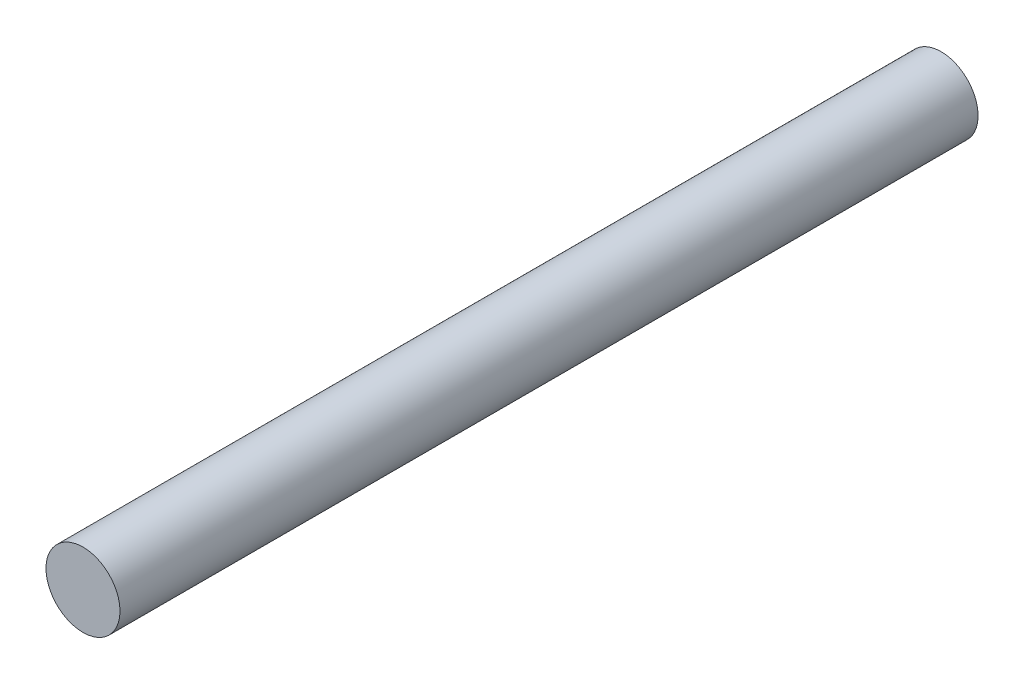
from build123d import *

# Parameters (mm, degrees)
ESQUISSE1_R          = 1.25
BASE_EXTRUSION_DEPTH = 29


with BuildPart() as part:
    # Esquisse1 → Base-Extrusion (new body)
    with BuildSketch(Plane.XY):
        with Locations(Location((0, 0, 0), (0, 0, 180))):
            Circle(ESQUISSE1_R)
    extrude(amount=BASE_EXTRUSION_DEPTH)


solid = part.part
